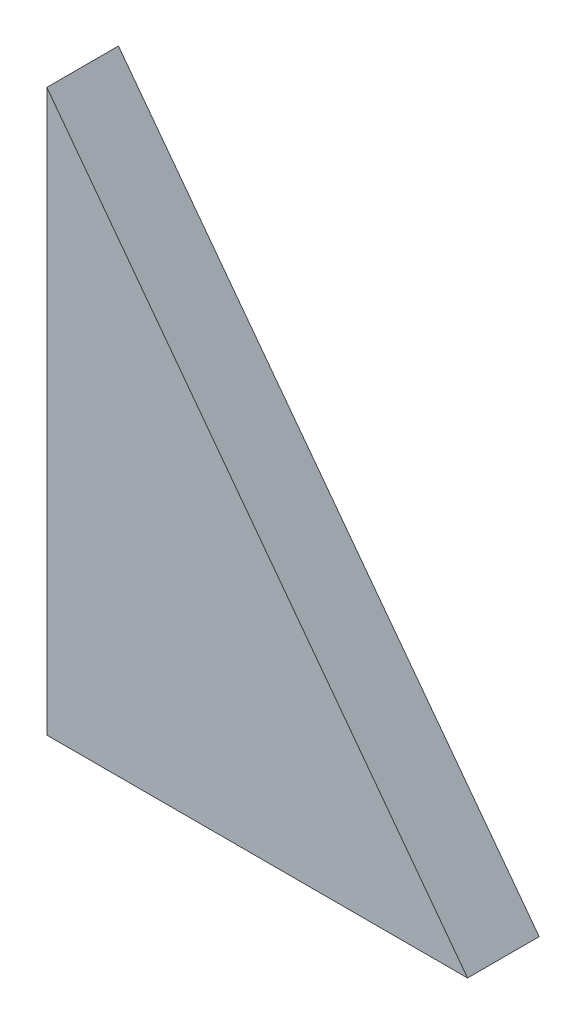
from build123d import *

# Parameters (mm, degrees)
BOSS_EXTRUDE2_DEPTH = 12.7


with BuildPart() as part:
    # Sketch2 → Boss-Extrude2 (new body)
    with BuildSketch(Plane.XY):
        Polygon((0, 99.473657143), (0, 0), (74.599914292, 0), align=None)
    extrude(amount=BOSS_EXTRUDE2_DEPTH)


solid = part.part
